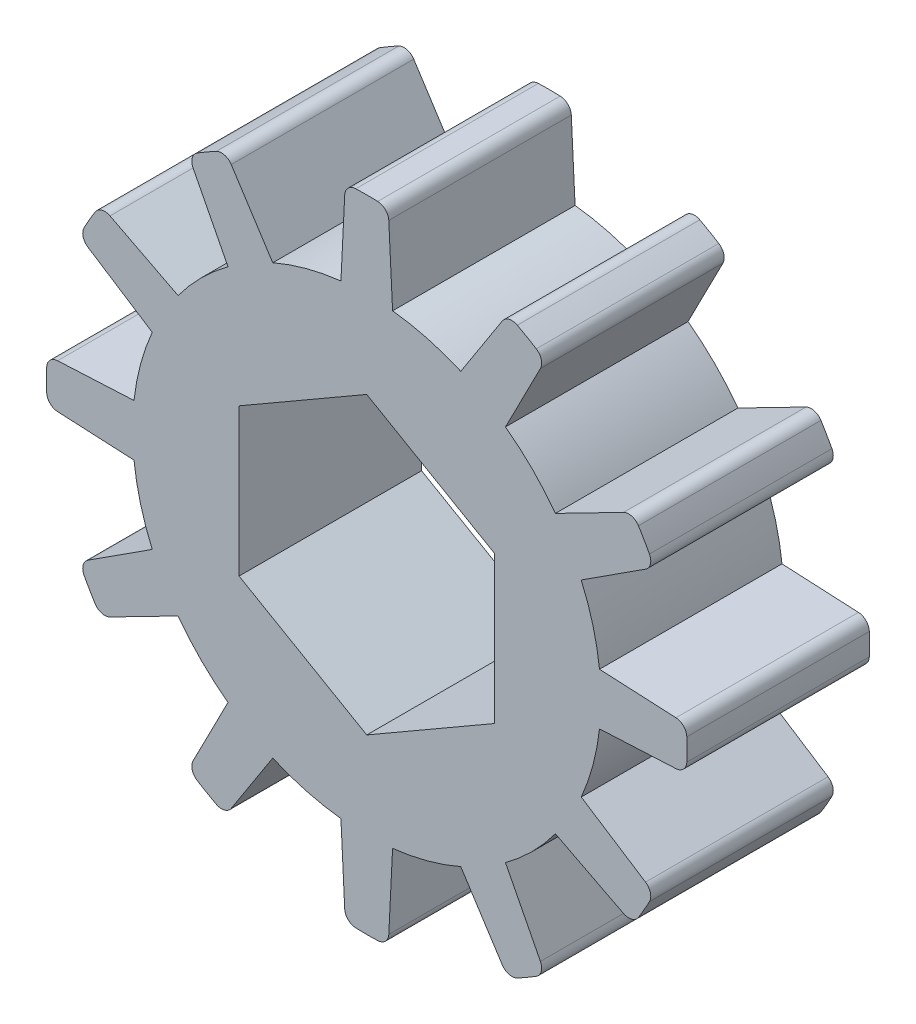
from build123d import *

# Parameters (mm, degrees)
CROQUIS1_R              = 0.5
SALIENTE_EXTRUIR1_DEPTH = 3.18
CORTAR_EXTRUIR3_DEPTH   = 9.508591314
REDONDEO1_R             = 0.2


with BuildPart() as part:
    # Croquis1 → Saliente-Extruir1 (new body)
    with BuildSketch(Plane.XY):
        with BuildLine():
            Line((0.375, 5.567875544), (0.45, 4.055600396))
            ThreePointArc((0.45, 4.055600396), (1.056108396, 3.941450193), (1.638088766, 3.737252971))
            Line((1.638088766, 3.737252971), (2.459178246, 5.009421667))
            ThreePointArc((2.459178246, 5.009421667), (2.790244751, 4.832845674), (3.108697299, 4.634421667))
            Line((3.108697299, 4.634421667), (2.41751163, 3.287252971))
            ThreePointArc((2.41751163, 3.287252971), (2.885341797, 2.885341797), (3.287252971, 2.41751163))
            Line((3.287252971, 2.41751163), (4.634421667, 3.108697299))
            ThreePointArc((4.634421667, 3.108697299), (4.832845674, 2.790244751), (5.009421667, 2.459178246))
            Line((5.009421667, 2.459178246), (3.737252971, 1.638088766))
            ThreePointArc((3.737252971, 1.638088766), (3.941450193, 1.056108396), (4.055600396, 0.45))
            Line((4.055600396, 0.45), (5.567875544, 0.375))
            ThreePointArc((5.567875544, 0.375), (5.580489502, 0), (5.567875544, -0.375))
            Line((5.567875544, -0.375), (4.055600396, -0.45))
            ThreePointArc((4.055600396, -0.45), (3.941450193, -1.056108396), (3.737252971, -1.638088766))
            Line((3.737252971, -1.638088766), (5.009421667, -2.459178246))
            ThreePointArc((5.009421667, -2.459178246), (4.832845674, -2.790244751), (4.634421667, -3.108697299))
            Line((4.634421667, -3.108697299), (3.287252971, -2.41751163))
            ThreePointArc((3.287252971, -2.41751163), (2.885341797, -2.885341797), (2.41751163, -3.287252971))
            Line((2.41751163, -3.287252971), (3.108697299, -4.634421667))
            ThreePointArc((3.108697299, -4.634421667), (2.790244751, -4.832845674), (2.459178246, -5.009421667))
            Line((2.459178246, -5.009421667), (1.638088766, -3.737252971))
            ThreePointArc((1.638088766, -3.737252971), (1.056108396, -3.941450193), (0.45, -4.055600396))
            Line((0.45, -4.055600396), (0.375, -5.567875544))
            ThreePointArc((0.375, -5.567875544), (0, -5.580489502), (-0.375, -5.567875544))
            Line((-0.375, -5.567875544), (-0.45, -4.055600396))
            ThreePointArc((-0.45, -4.055600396), (-1.056108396, -3.941450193), (-1.638088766, -3.737252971))
            Line((-1.638088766, -3.737252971), (-2.459178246, -5.009421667))
            ThreePointArc((-2.459178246, -5.009421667), (-2.790244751, -4.832845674), (-3.108697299, -4.634421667))
            Line((-3.108697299, -4.634421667), (-2.41751163, -3.287252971))
            ThreePointArc((-2.41751163, -3.287252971), (-2.885341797, -2.885341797), (-3.287252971, -2.41751163))
            Line((-3.287252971, -2.41751163), (-4.634421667, -3.108697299))
            ThreePointArc((-4.634421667, -3.108697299), (-4.832845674, -2.790244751), (-5.009421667, -2.459178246))
            Line((-5.009421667, -2.459178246), (-3.737252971, -1.638088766))
            ThreePointArc((-3.737252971, -1.638088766), (-3.941450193, -1.056108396), (-4.055600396, -0.45))
            Line((-4.055600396, -0.45), (-5.567875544, -0.375))
            ThreePointArc((-5.567875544, -0.375), (-5.580489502, 0), (-5.567875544, 0.375))
            Line((-5.567875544, 0.375), (-4.055600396, 0.45))
            ThreePointArc((-4.055600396, 0.45), (-3.941450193, 1.056108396), (-3.737252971, 1.638088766))
            Line((-3.737252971, 1.638088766), (-5.009421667, 2.459178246))
            ThreePointArc((-5.009421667, 2.459178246), (-4.832845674, 2.790244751), (-4.634421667, 3.108697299))
            Line((-4.634421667, 3.108697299), (-3.287252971, 2.41751163))
            ThreePointArc((-3.287252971, 2.41751163), (-2.885341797, 2.885341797), (-2.41751163, 3.287252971))
            Line((-2.41751163, 3.287252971), (-3.108697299, 4.634421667))
            ThreePointArc((-3.108697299, 4.634421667), (-2.790244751, 4.832845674), (-2.459178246, 5.009421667))
            Line((-2.459178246, 5.009421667), (-1.638088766, 3.737252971))
            ThreePointArc((-1.638088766, 3.737252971), (-1.056108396, 3.941450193), (-0.45, 4.055600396))
            Line((-0.45, 4.055600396), (-0.375, 5.567875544))
            ThreePointArc((-0.375, 5.567875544), (0, 5.580489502), (0.375, 5.567875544))
        make_face()
        Circle(CROQUIS1_R, mode=Mode.SUBTRACT)
    extrude(amount=SALIENTE_EXTRUIR1_DEPTH)

    # Croquis10 → Cortar-Extruir3 (cut, through all)
    with BuildSketch(Plane(origin=(0, 0, 0), x_dir=(-1, 0, 0), z_dir=(0, 0, -1))):
        Polygon((0, -2.569208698), (2.225, -1.284604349), (2.225, 1.284604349), (0, 2.569208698), (-2.225, 1.284604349), (-2.225, -1.284604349), align=None)
    extrude(amount=-CORTAR_EXTRUIR3_DEPTH, mode=Mode.SUBTRACT)

    # Redondeo1
    redondeo1_edges = [part.edges().sort_by_distance(p)[0] for p in [
        (0.375, 5.567875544, 1.59),
        (2.459178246, 5.009421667, 1.59),
        (3.108697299, 4.634421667, 1.59),
        (4.634421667, 3.108697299, 1.59),
        (5.009421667, 2.459178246, 1.59),
        (5.567875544, 0.375, 1.59),
        (5.567875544, -0.375, 1.59),
        (5.009421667, -2.459178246, 1.59),
        (4.634421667, -3.108697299, 1.59),
        (3.108697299, -4.634421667, 1.59),
        (2.459178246, -5.009421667, 1.59),
        (0.375, -5.567875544, 1.59),
        (-0.375, -5.567875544, 1.59),
        (-2.459178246, -5.009421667, 1.59),
        (-3.108697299, -4.634421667, 1.59),
        (-4.634421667, -3.108697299, 1.59),
        (-5.009421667, -2.459178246, 1.59),
        (-5.567875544, -0.375, 1.59),
        (-5.567875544, 0.375, 1.59),
        (-5.009421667, 2.459178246, 1.59),
        (-4.634421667, 3.108697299, 1.59),
        (-3.108697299, 4.634421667, 1.59),
        (-2.459178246, 5.009421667, 1.59),
        (-0.375, 5.567875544, 1.59),
    ]]
    fillet(redondeo1_edges, radius=REDONDEO1_R)


solid = part.part
